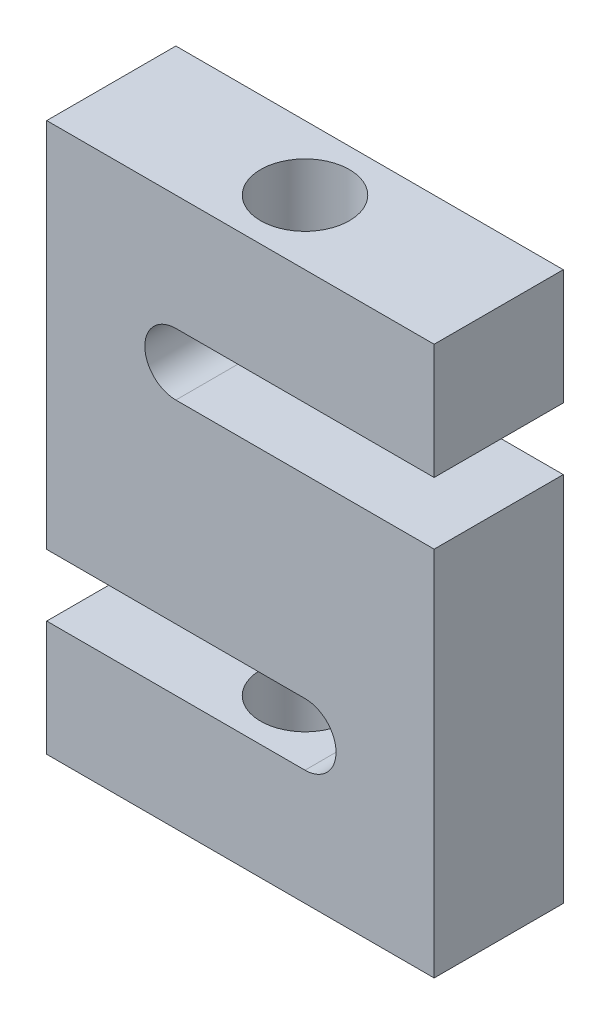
ISO-10303-21;
HEADER;
FILE_DESCRIPTION(('STEP AP214'),'2;1');
FILE_NAME('part.step','',(''),(''),'','','');
FILE_SCHEMA(('AUTOMOTIVE_DESIGN { 1 0 10303 214 1 1 1 1 }'));
ENDSEC;
DATA;
#1=APPLICATION_CONTEXT('core data for automotive mechanical design processes');
#2=APPLICATION_PROTOCOL_DEFINITION('international standard','automotive_design',2000,#1);
#3=PRODUCT_CONTEXT('',#1,'mechanical');
#4=PRODUCT('Part','Part','',(#3));
#5=PRODUCT_RELATED_PRODUCT_CATEGORY('part','',(#4));
#6=PRODUCT_DEFINITION_FORMATION('','',#4);
#7=PRODUCT_DEFINITION_CONTEXT('part definition',#1,'design');
#8=PRODUCT_DEFINITION('design','',#6,#7);
#9=PRODUCT_DEFINITION_SHAPE('','',#8);
#10=(LENGTH_UNIT() NAMED_UNIT(*) SI_UNIT(.MILLI.,.METRE.));
#11=(NAMED_UNIT(*) PLANE_ANGLE_UNIT() SI_UNIT($,.RADIAN.));
#12=(NAMED_UNIT(*) SI_UNIT($,.STERADIAN.) SOLID_ANGLE_UNIT());
#13=UNCERTAINTY_MEASURE_WITH_UNIT(LENGTH_MEASURE(1.E-05),#10,'distance_accuracy_value','');
#14=(GEOMETRIC_REPRESENTATION_CONTEXT(3) GLOBAL_UNCERTAINTY_ASSIGNED_CONTEXT((#13)) GLOBAL_UNIT_ASSIGNED_CONTEXT((#10,
#11,#12)) REPRESENTATION_CONTEXT('',''));
#15=CARTESIAN_POINT('',(0.,0.,0.));
#16=DIRECTION('',(0.,0.,1.));
#17=DIRECTION('',(1.,0.,0.));
#18=AXIS2_PLACEMENT_3D('',#15,#16,#17);
#19=CARTESIAN_POINT('',(38.1,19.075,12.7));
#20=DIRECTION('',(-1.,0.,0.));
#21=DIRECTION('',(0.,-1.,0.));
#22=AXIS2_PLACEMENT_3D('',#19,#20,#21);
#23=PLANE('',#22);
#24=DIRECTION('',(0.,1.,0.));
#25=VECTOR('',#24,1.);
#26=CARTESIAN_POINT('',(38.1,19.075,-12.7));
#27=LINE('',#26,#25);
#28=CARTESIAN_POINT('',(38.1,-53.975,-12.7));
#29=VERTEX_POINT('',#28);
#30=CARTESIAN_POINT('',(38.1,19.075,-12.7));
#31=VERTEX_POINT('',#30);
#32=EDGE_CURVE('E155',#29,#31,#27,.T.);
#33=ORIENTED_EDGE('',*,*,#32,.T.);
#34=DIRECTION('',(0.,0.,-1.));
#35=VECTOR('',#34,1.);
#36=CARTESIAN_POINT('',(38.1,19.075,12.7));
#37=LINE('',#36,#35);
#38=CARTESIAN_POINT('',(38.1,19.075,12.7));
#39=VERTEX_POINT('',#38);
#40=EDGE_CURVE('E11',#39,#31,#37,.T.);
#41=ORIENTED_EDGE('',*,*,#40,.F.);
#42=DIRECTION('',(0.,1.,0.));
#43=VECTOR('',#42,1.);
#44=CARTESIAN_POINT('',(38.1,19.075,12.7));
#45=LINE('',#44,#43);
#46=CARTESIAN_POINT('',(38.1,-53.975,12.7));
#47=VERTEX_POINT('',#46);
#48=EDGE_CURVE('E178',#47,#39,#45,.T.);
#49=ORIENTED_EDGE('',*,*,#48,.F.);
#50=DIRECTION('',(0.,0.,-1.));
#51=VECTOR('',#50,1.);
#52=CARTESIAN_POINT('',(38.1,-53.975,12.7));
#53=LINE('',#52,#51);
#54=EDGE_CURVE('E151',#47,#29,#53,.T.);
#55=ORIENTED_EDGE('',*,*,#54,.T.);
#56=EDGE_LOOP('',(#33,#41,#49,#55));
#57=FACE_BOUND('',#56,.T.);
#58=ADVANCED_FACE('F35',(#57),#23,.F.);
#59=CARTESIAN_POINT('',(38.1,19.075,12.7));
#60=DIRECTION('',(0.,-1.,0.));
#61=DIRECTION('',(1.,0.,0.));
#62=AXIS2_PLACEMENT_3D('',#59,#60,#61);
#63=PLANE('',#62);
#64=DIRECTION('',(-1.,0.,0.));
#65=VECTOR('',#64,1.);
#66=CARTESIAN_POINT('',(38.1,19.075,-12.7));
#67=LINE('',#66,#65);
#68=CARTESIAN_POINT('',(-12.7,19.075,-12.7));
#69=VERTEX_POINT('',#68);
#70=EDGE_CURVE('E158',#31,#69,#67,.T.);
#71=ORIENTED_EDGE('',*,*,#70,.T.);
#72=DIRECTION('',(0.,0.,-1.));
#73=VECTOR('',#72,1.);
#74=CARTESIAN_POINT('',(-12.7,19.075,12.7));
#75=LINE('',#74,#73);
#76=CARTESIAN_POINT('',(-12.7,19.075,12.7));
#77=VERTEX_POINT('',#76);
#78=EDGE_CURVE('E43',#77,#69,#75,.T.);
#79=ORIENTED_EDGE('',*,*,#78,.F.);
#80=DIRECTION('',(-1.,0.,0.));
#81=VECTOR('',#80,1.);
#82=CARTESIAN_POINT('',(38.1,19.075,12.7));
#83=LINE('',#82,#81);
#84=EDGE_CURVE('E106',#39,#77,#83,.T.);
#85=ORIENTED_EDGE('',*,*,#84,.F.);
#86=ORIENTED_EDGE('',*,*,#40,.T.);
#87=EDGE_LOOP('',(#71,#79,#85,#86));
#88=FACE_BOUND('',#87,.T.);
#89=ADVANCED_FACE('F258',(#88),#63,.F.);
#90=CARTESIAN_POINT('',(-12.7,25.175,12.7));
#91=DIRECTION('',(0.,0.,-1.));
#92=DIRECTION('',(-1.,0.,0.));
#93=AXIS2_PLACEMENT_3D('',#90,#91,#92);
#94=CYLINDRICAL_SURFACE('',#93,6.09999999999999);
#95=CARTESIAN_POINT('',(-12.7,25.175,-12.7));
#96=DIRECTION('',(0.,0.,-1.));
#97=DIRECTION('',(1.,0.,0.));
#98=AXIS2_PLACEMENT_3D('',#95,#96,#97);
#99=CIRCLE('',#98,6.09999999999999);
#100=CARTESIAN_POINT('',(-12.7,31.275,-12.7));
#101=VERTEX_POINT('',#100);
#102=EDGE_CURVE('E161',#69,#101,#99,.T.);
#103=ORIENTED_EDGE('',*,*,#102,.T.);
#104=DIRECTION('',(0.,0.,-1.));
#105=VECTOR('',#104,1.);
#106=CARTESIAN_POINT('',(-12.7,31.275,12.7));
#107=LINE('',#106,#105);
#108=CARTESIAN_POINT('',(-12.7,31.275,12.7));
#109=VERTEX_POINT('',#108);
#110=EDGE_CURVE('E197',#109,#101,#107,.T.);
#111=ORIENTED_EDGE('',*,*,#110,.F.);
#112=CARTESIAN_POINT('',(-12.7,25.175,12.7));
#113=DIRECTION('',(0.,0.,-1.));
#114=DIRECTION('',(1.,0.,0.));
#115=AXIS2_PLACEMENT_3D('',#112,#113,#114);
#116=CIRCLE('',#115,6.09999999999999);
#117=EDGE_CURVE('E205',#77,#109,#116,.T.);
#118=ORIENTED_EDGE('',*,*,#117,.F.);
#119=ORIENTED_EDGE('',*,*,#78,.T.);
#120=EDGE_LOOP('',(#103,#111,#118,#119));
#121=FACE_BOUND('',#120,.T.);
#122=ADVANCED_FACE('F203',(#121),#94,.F.);
#123=CARTESIAN_POINT('',(38.1,31.275,12.7));
#124=DIRECTION('',(0.,1.,0.));
#125=DIRECTION('',(-1.,0.,0.));
#126=AXIS2_PLACEMENT_3D('',#123,#124,#125);
#127=PLANE('',#126);
#128=CARTESIAN_POINT('',(0.,31.275,0.));
#129=DIRECTION('',(0.,1.,0.));
#130=DIRECTION('',(-1.,0.,0.));
#131=AXIS2_PLACEMENT_3D('',#128,#129,#130);
#132=CIRCLE('',#131,8.73124999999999);
#133=CARTESIAN_POINT('',(-8.73124999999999,31.275,0.));
#134=VERTEX_POINT('',#133);
#135=EDGE_CURVE('E159',#134,#134,#132,.T.);
#136=ORIENTED_EDGE('',*,*,#135,.T.);
#137=EDGE_LOOP('',(#136));
#138=FACE_BOUND('',#137,.T.);
#139=DIRECTION('',(1.,0.,0.));
#140=VECTOR('',#139,1.);
#141=CARTESIAN_POINT('',(38.1,31.275,-12.7));
#142=LINE('',#141,#140);
#143=CARTESIAN_POINT('',(38.1,31.275,-12.7));
#144=VERTEX_POINT('',#143);
#145=EDGE_CURVE('E163',#101,#144,#142,.T.);
#146=ORIENTED_EDGE('',*,*,#145,.T.);
#147=DIRECTION('',(0.,0.,-1.));
#148=VECTOR('',#147,1.);
#149=CARTESIAN_POINT('',(38.1,31.275,12.7));
#150=LINE('',#149,#148);
#151=CARTESIAN_POINT('',(38.1,31.275,12.7));
#152=VERTEX_POINT('',#151);
#153=EDGE_CURVE('E194',#152,#144,#150,.T.);
#154=ORIENTED_EDGE('',*,*,#153,.F.);
#155=DIRECTION('',(1.,0.,0.));
#156=VECTOR('',#155,1.);
#157=CARTESIAN_POINT('',(38.1,31.275,12.7));
#158=LINE('',#157,#156);
#159=EDGE_CURVE('E223',#109,#152,#158,.T.);
#160=ORIENTED_EDGE('',*,*,#159,.F.);
#161=ORIENTED_EDGE('',*,*,#110,.T.);
#162=EDGE_LOOP('',(#146,#154,#160,#161));
#163=FACE_BOUND('',#162,.T.);
#164=ADVANCED_FACE('F214',(#138,#163),#127,.F.);
#165=CARTESIAN_POINT('',(38.1,53.975,12.7));
#166=DIRECTION('',(-1.,0.,0.));
#167=DIRECTION('',(0.,0.,1.));
#168=AXIS2_PLACEMENT_3D('',#165,#166,#167);
#169=PLANE('',#168);
#170=DIRECTION('',(0.,1.,0.));
#171=VECTOR('',#170,1.);
#172=CARTESIAN_POINT('',(38.1,53.975,-12.7));
#173=LINE('',#172,#171);
#174=CARTESIAN_POINT('',(38.1,53.975,-12.7));
#175=VERTEX_POINT('',#174);
#176=EDGE_CURVE('E165',#144,#175,#173,.T.);
#177=ORIENTED_EDGE('',*,*,#176,.T.);
#178=DIRECTION('',(0.,0.,-1.));
#179=VECTOR('',#178,1.);
#180=CARTESIAN_POINT('',(38.1,53.975,12.7));
#181=LINE('',#180,#179);
#182=CARTESIAN_POINT('',(38.1,53.975,12.7));
#183=VERTEX_POINT('',#182);
#184=EDGE_CURVE('E191',#183,#175,#181,.T.);
#185=ORIENTED_EDGE('',*,*,#184,.F.);
#186=DIRECTION('',(0.,1.,0.));
#187=VECTOR('',#186,1.);
#188=CARTESIAN_POINT('',(38.1,53.975,12.7));
#189=LINE('',#188,#187);
#190=EDGE_CURVE('E220',#152,#183,#189,.T.);
#191=ORIENTED_EDGE('',*,*,#190,.F.);
#192=ORIENTED_EDGE('',*,*,#153,.T.);
#193=EDGE_LOOP('',(#177,#185,#191,#192));
#194=FACE_BOUND('',#193,.T.);
#195=ADVANCED_FACE('F218',(#194),#169,.F.);
#196=CARTESIAN_POINT('',(-38.1,53.975,12.7));
#197=DIRECTION('',(0.,-1.,0.));
#198=DIRECTION('',(0.,0.,-1.));
#199=AXIS2_PLACEMENT_3D('',#196,#197,#198);
#200=PLANE('',#199);
#201=CARTESIAN_POINT('',(0.,53.975,0.));
#202=DIRECTION('',(0.,1.,0.));
#203=DIRECTION('',(0.,0.,1.));
#204=AXIS2_PLACEMENT_3D('',#201,#202,#203);
#205=CIRCLE('',#204,8.73124999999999);
#206=CARTESIAN_POINT('',(0.,53.975,8.73124999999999));
#207=VERTEX_POINT('',#206);
#208=EDGE_CURVE('E292',#207,#207,#205,.T.);
#209=ORIENTED_EDGE('',*,*,#208,.F.);
#210=EDGE_LOOP('',(#209));
#211=FACE_BOUND('',#210,.T.);
#212=DIRECTION('',(-1.,0.,0.));
#213=VECTOR('',#212,1.);
#214=CARTESIAN_POINT('',(-38.1,53.975,-12.7));
#215=LINE('',#214,#213);
#216=CARTESIAN_POINT('',(-38.1,53.975,-12.7));
#217=VERTEX_POINT('',#216);
#218=EDGE_CURVE('E167',#175,#217,#215,.T.);
#219=ORIENTED_EDGE('',*,*,#218,.T.);
#220=DIRECTION('',(0.,0.,-1.));
#221=VECTOR('',#220,1.);
#222=CARTESIAN_POINT('',(-38.1,53.975,12.7));
#223=LINE('',#222,#221);
#224=CARTESIAN_POINT('',(-38.1,53.975,12.7));
#225=VERTEX_POINT('',#224);
#226=EDGE_CURVE('E188',#225,#217,#223,.T.);
#227=ORIENTED_EDGE('',*,*,#226,.F.);
#228=DIRECTION('',(-1.,0.,0.));
#229=VECTOR('',#228,1.);
#230=CARTESIAN_POINT('',(-38.1,53.975,12.7));
#231=LINE('',#230,#229);
#232=EDGE_CURVE('E222',#183,#225,#231,.T.);
#233=ORIENTED_EDGE('',*,*,#232,.F.);
#234=ORIENTED_EDGE('',*,*,#184,.T.);
#235=EDGE_LOOP('',(#219,#227,#233,#234));
#236=FACE_BOUND('',#235,.T.);
#237=ADVANCED_FACE('F272',(#211,#236),#200,.F.);
#238=CARTESIAN_POINT('',(-38.1,53.975,12.7));
#239=DIRECTION('',(1.,0.,0.));
#240=DIRECTION('',(0.,1.,0.));
#241=AXIS2_PLACEMENT_3D('',#238,#239,#240);
#242=PLANE('',#241);
#243=DIRECTION('',(0.,-1.,0.));
#244=VECTOR('',#243,1.);
#245=CARTESIAN_POINT('',(-38.1,53.975,-12.7));
#246=LINE('',#245,#244);
#247=CARTESIAN_POINT('',(-38.1,-19.075,-12.7));
#248=VERTEX_POINT('',#247);
#249=EDGE_CURVE('E169',#217,#248,#246,.T.);
#250=ORIENTED_EDGE('',*,*,#249,.T.);
#251=DIRECTION('',(0.,0.,-1.));
#252=VECTOR('',#251,1.);
#253=CARTESIAN_POINT('',(-38.1,-19.075,12.7));
#254=LINE('',#253,#252);
#255=CARTESIAN_POINT('',(-38.1,-19.075,12.7));
#256=VERTEX_POINT('',#255);
#257=EDGE_CURVE('E185',#256,#248,#254,.T.);
#258=ORIENTED_EDGE('',*,*,#257,.F.);
#259=DIRECTION('',(0.,-1.,0.));
#260=VECTOR('',#259,1.);
#261=CARTESIAN_POINT('',(-38.1,53.975,12.7));
#262=LINE('',#261,#260);
#263=EDGE_CURVE('E225',#225,#256,#262,.T.);
#264=ORIENTED_EDGE('',*,*,#263,.F.);
#265=ORIENTED_EDGE('',*,*,#226,.T.);
#266=EDGE_LOOP('',(#250,#258,#264,#265));
#267=FACE_BOUND('',#266,.T.);
#268=ADVANCED_FACE('F275',(#267),#242,.F.);
#269=CARTESIAN_POINT('',(-38.1,-19.075,12.7));
#270=DIRECTION('',(0.,1.,0.));
#271=DIRECTION('',(-1.,0.,0.));
#272=AXIS2_PLACEMENT_3D('',#269,#270,#271);
#273=PLANE('',#272);
#274=DIRECTION('',(1.,0.,0.));
#275=VECTOR('',#274,1.);
#276=CARTESIAN_POINT('',(-38.1,-19.075,-12.7));
#277=LINE('',#276,#275);
#278=CARTESIAN_POINT('',(12.7,-19.075,-12.7));
#279=VERTEX_POINT('',#278);
#280=EDGE_CURVE('E171',#248,#279,#277,.T.);
#281=ORIENTED_EDGE('',*,*,#280,.T.);
#282=DIRECTION('',(0.,0.,-1.));
#283=VECTOR('',#282,1.);
#284=CARTESIAN_POINT('',(12.7,-19.075,12.7));
#285=LINE('',#284,#283);
#286=CARTESIAN_POINT('',(12.7,-19.075,12.7));
#287=VERTEX_POINT('',#286);
#288=EDGE_CURVE('E182',#287,#279,#285,.T.);
#289=ORIENTED_EDGE('',*,*,#288,.F.);
#290=DIRECTION('',(1.,0.,0.));
#291=VECTOR('',#290,1.);
#292=CARTESIAN_POINT('',(-38.1,-19.075,12.7));
#293=LINE('',#292,#291);
#294=EDGE_CURVE('E231',#256,#287,#293,.T.);
#295=ORIENTED_EDGE('',*,*,#294,.F.);
#296=ORIENTED_EDGE('',*,*,#257,.T.);
#297=EDGE_LOOP('',(#281,#289,#295,#296));
#298=FACE_BOUND('',#297,.T.);
#299=ADVANCED_FACE('F237',(#298),#273,.F.);
#300=CARTESIAN_POINT('',(12.7,-25.175,12.7));
#301=DIRECTION('',(0.,0.,-1.));
#302=DIRECTION('',(-1.,0.,0.));
#303=AXIS2_PLACEMENT_3D('',#300,#301,#302);
#304=CYLINDRICAL_SURFACE('',#303,6.09999999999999);
#305=CARTESIAN_POINT('',(12.7,-25.175,-12.7));
#306=DIRECTION('',(0.,0.,-1.));
#307=DIRECTION('',(1.,0.,0.));
#308=AXIS2_PLACEMENT_3D('',#305,#306,#307);
#309=CIRCLE('',#308,6.09999999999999);
#310=CARTESIAN_POINT('',(12.7,-31.275,-12.7));
#311=VERTEX_POINT('',#310);
#312=EDGE_CURVE('E173',#279,#311,#309,.T.);
#313=ORIENTED_EDGE('',*,*,#312,.T.);
#314=DIRECTION('',(0.,0.,-1.));
#315=VECTOR('',#314,1.);
#316=CARTESIAN_POINT('',(12.7,-31.275,12.7));
#317=LINE('',#316,#315);
#318=CARTESIAN_POINT('',(12.7,-31.275,12.7));
#319=VERTEX_POINT('',#318);
#320=EDGE_CURVE('E146',#319,#311,#317,.T.);
#321=ORIENTED_EDGE('',*,*,#320,.F.);
#322=CARTESIAN_POINT('',(12.7,-25.175,12.7));
#323=DIRECTION('',(0.,0.,-1.));
#324=DIRECTION('',(1.,0.,0.));
#325=AXIS2_PLACEMENT_3D('',#322,#323,#324);
#326=CIRCLE('',#325,6.09999999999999);
#327=EDGE_CURVE('E137',#287,#319,#326,.T.);
#328=ORIENTED_EDGE('',*,*,#327,.F.);
#329=ORIENTED_EDGE('',*,*,#288,.T.);
#330=EDGE_LOOP('',(#313,#321,#328,#329));
#331=FACE_BOUND('',#330,.T.);
#332=ADVANCED_FACE('F241',(#331),#304,.F.);
#333=CARTESIAN_POINT('',(12.7,-31.275,12.7));
#334=DIRECTION('',(0.,-1.,0.));
#335=DIRECTION('',(1.,0.,0.));
#336=AXIS2_PLACEMENT_3D('',#333,#334,#335);
#337=PLANE('',#336);
#338=CARTESIAN_POINT('',(0.,-31.275,0.));
#339=DIRECTION('',(0.,-1.,0.));
#340=DIRECTION('',(1.,0.,0.));
#341=AXIS2_PLACEMENT_3D('',#338,#339,#340);
#342=CIRCLE('',#341,8.73124999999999);
#343=CARTESIAN_POINT('',(8.73124999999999,-31.275,0.));
#344=VERTEX_POINT('',#343);
#345=EDGE_CURVE('E290',#344,#344,#342,.T.);
#346=ORIENTED_EDGE('',*,*,#345,.T.);
#347=EDGE_LOOP('',(#346));
#348=FACE_BOUND('',#347,.T.);
#349=DIRECTION('',(-1.,0.,0.));
#350=VECTOR('',#349,1.);
#351=CARTESIAN_POINT('',(12.7,-31.275,-12.7));
#352=LINE('',#351,#350);
#353=CARTESIAN_POINT('',(-38.1,-31.275,-12.7));
#354=VERTEX_POINT('',#353);
#355=EDGE_CURVE('E145',#311,#354,#352,.T.);
#356=ORIENTED_EDGE('',*,*,#355,.T.);
#357=DIRECTION('',(0.,0.,-1.));
#358=VECTOR('',#357,1.);
#359=CARTESIAN_POINT('',(-38.1,-31.275,12.7));
#360=LINE('',#359,#358);
#361=CARTESIAN_POINT('',(-38.1,-31.275,12.7));
#362=VERTEX_POINT('',#361);
#363=EDGE_CURVE('E142',#362,#354,#360,.T.);
#364=ORIENTED_EDGE('',*,*,#363,.F.);
#365=DIRECTION('',(-1.,0.,0.));
#366=VECTOR('',#365,1.);
#367=CARTESIAN_POINT('',(12.7,-31.275,12.7));
#368=LINE('',#367,#366);
#369=EDGE_CURVE('E131',#319,#362,#368,.T.);
#370=ORIENTED_EDGE('',*,*,#369,.F.);
#371=ORIENTED_EDGE('',*,*,#320,.T.);
#372=EDGE_LOOP('',(#356,#364,#370,#371));
#373=FACE_BOUND('',#372,.T.);
#374=ADVANCED_FACE('F143',(#348,#373),#337,.F.);
#375=CARTESIAN_POINT('',(-38.1,-31.275,12.7));
#376=DIRECTION('',(1.,0.,0.));
#377=DIRECTION('',(0.,1.,0.));
#378=AXIS2_PLACEMENT_3D('',#375,#376,#377);
#379=PLANE('',#378);
#380=DIRECTION('',(0.,-1.,0.));
#381=VECTOR('',#380,1.);
#382=CARTESIAN_POINT('',(-38.1,-31.275,-12.7));
#383=LINE('',#382,#381);
#384=CARTESIAN_POINT('',(-38.1,-53.975,-12.7));
#385=VERTEX_POINT('',#384);
#386=EDGE_CURVE('E92',#354,#385,#383,.T.);
#387=ORIENTED_EDGE('',*,*,#386,.T.);
#388=DIRECTION('',(0.,0.,-1.));
#389=VECTOR('',#388,1.);
#390=CARTESIAN_POINT('',(-38.1,-53.975,12.7));
#391=LINE('',#390,#389);
#392=CARTESIAN_POINT('',(-38.1,-53.975,12.7));
#393=VERTEX_POINT('',#392);
#394=EDGE_CURVE('E147',#393,#385,#391,.T.);
#395=ORIENTED_EDGE('',*,*,#394,.F.);
#396=DIRECTION('',(0.,-1.,0.));
#397=VECTOR('',#396,1.);
#398=CARTESIAN_POINT('',(-38.1,-31.275,12.7));
#399=LINE('',#398,#397);
#400=EDGE_CURVE('E135',#362,#393,#399,.T.);
#401=ORIENTED_EDGE('',*,*,#400,.F.);
#402=ORIENTED_EDGE('',*,*,#363,.T.);
#403=EDGE_LOOP('',(#387,#395,#401,#402));
#404=FACE_BOUND('',#403,.T.);
#405=ADVANCED_FACE('F149',(#404),#379,.F.);
#406=CARTESIAN_POINT('',(-38.1,-53.975,12.7));
#407=DIRECTION('',(0.,1.,0.));
#408=DIRECTION('',(0.,0.,1.));
#409=AXIS2_PLACEMENT_3D('',#406,#407,#408);
#410=PLANE('',#409);
#411=CARTESIAN_POINT('',(0.,-53.975,0.));
#412=DIRECTION('',(0.,-1.,0.));
#413=DIRECTION('',(0.,0.,-1.));
#414=AXIS2_PLACEMENT_3D('',#411,#412,#413);
#415=CIRCLE('',#414,8.73124999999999);
#416=CARTESIAN_POINT('',(0.,-53.975,-8.73124999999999));
#417=VERTEX_POINT('',#416);
#418=EDGE_CURVE('E293',#417,#417,#415,.T.);
#419=ORIENTED_EDGE('',*,*,#418,.F.);
#420=EDGE_LOOP('',(#419));
#421=FACE_BOUND('',#420,.T.);
#422=DIRECTION('',(1.,0.,0.));
#423=VECTOR('',#422,1.);
#424=CARTESIAN_POINT('',(-38.1,-53.975,-12.7));
#425=LINE('',#424,#423);
#426=EDGE_CURVE('E98',#385,#29,#425,.T.);
#427=ORIENTED_EDGE('',*,*,#426,.T.);
#428=ORIENTED_EDGE('',*,*,#54,.F.);
#429=DIRECTION('',(1.,0.,0.));
#430=VECTOR('',#429,1.);
#431=CARTESIAN_POINT('',(-38.1,-53.975,12.7));
#432=LINE('',#431,#430);
#433=EDGE_CURVE('E51',#393,#47,#432,.T.);
#434=ORIENTED_EDGE('',*,*,#433,.F.);
#435=ORIENTED_EDGE('',*,*,#394,.T.);
#436=EDGE_LOOP('',(#427,#428,#434,#435));
#437=FACE_BOUND('',#436,.T.);
#438=ADVANCED_FACE('F245',(#421,#437),#410,.F.);
#439=CARTESIAN_POINT('',(12.7,-25.175,12.7));
#440=DIRECTION('',(0.,0.,1.));
#441=DIRECTION('',(1.,0.,0.));
#442=AXIS2_PLACEMENT_3D('',#439,#440,#441);
#443=PLANE('',#442);
#444=ORIENTED_EDGE('',*,*,#48,.T.);
#445=ORIENTED_EDGE('',*,*,#84,.T.);
#446=ORIENTED_EDGE('',*,*,#117,.T.);
#447=ORIENTED_EDGE('',*,*,#159,.T.);
#448=ORIENTED_EDGE('',*,*,#190,.T.);
#449=ORIENTED_EDGE('',*,*,#232,.T.);
#450=ORIENTED_EDGE('',*,*,#263,.T.);
#451=ORIENTED_EDGE('',*,*,#294,.T.);
#452=ORIENTED_EDGE('',*,*,#327,.T.);
#453=ORIENTED_EDGE('',*,*,#369,.T.);
#454=ORIENTED_EDGE('',*,*,#400,.T.);
#455=ORIENTED_EDGE('',*,*,#433,.T.);
#456=EDGE_LOOP('',(#444,#445,#446,#447,#448,#449,#450,#451,#452,#453,#454,#455));
#457=FACE_BOUND('',#456,.T.);
#458=ADVANCED_FACE('F133',(#457),#443,.T.);
#459=CARTESIAN_POINT('',(12.7,-25.175,-12.7));
#460=DIRECTION('',(0.,0.,1.));
#461=DIRECTION('',(1.,0.,0.));
#462=AXIS2_PLACEMENT_3D('',#459,#460,#461);
#463=PLANE('',#462);
#464=ORIENTED_EDGE('',*,*,#32,.F.);
#465=ORIENTED_EDGE('',*,*,#426,.F.);
#466=ORIENTED_EDGE('',*,*,#386,.F.);
#467=ORIENTED_EDGE('',*,*,#355,.F.);
#468=ORIENTED_EDGE('',*,*,#312,.F.);
#469=ORIENTED_EDGE('',*,*,#280,.F.);
#470=ORIENTED_EDGE('',*,*,#249,.F.);
#471=ORIENTED_EDGE('',*,*,#218,.F.);
#472=ORIENTED_EDGE('',*,*,#176,.F.);
#473=ORIENTED_EDGE('',*,*,#145,.F.);
#474=ORIENTED_EDGE('',*,*,#102,.F.);
#475=ORIENTED_EDGE('',*,*,#70,.F.);
#476=EDGE_LOOP('',(#464,#465,#466,#467,#468,#469,#470,#471,#472,#473,#474,#475));
#477=FACE_BOUND('',#476,.T.);
#478=ADVANCED_FACE('F209',(#477),#463,.F.);
#479=CARTESIAN_POINT('',(0.,53.975,0.));
#480=DIRECTION('',(0.,1.,0.));
#481=DIRECTION('',(0.,0.,1.));
#482=AXIS2_PLACEMENT_3D('',#479,#480,#481);
#483=CYLINDRICAL_SURFACE('',#482,8.73124999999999);
#484=ORIENTED_EDGE('',*,*,#135,.F.);
#485=EDGE_LOOP('',(#484));
#486=FACE_BOUND('',#485,.T.);
#487=ORIENTED_EDGE('',*,*,#208,.T.);
#488=EDGE_LOOP('',(#487));
#489=FACE_BOUND('',#488,.T.);
#490=ADVANCED_FACE('F305',(#486,#489),#483,.F.);
#491=CARTESIAN_POINT('',(0.,-53.975,0.));
#492=DIRECTION('',(0.,-1.,0.));
#493=DIRECTION('',(0.,0.,-1.));
#494=AXIS2_PLACEMENT_3D('',#491,#492,#493);
#495=CYLINDRICAL_SURFACE('',#494,8.73124999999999);
#496=ORIENTED_EDGE('',*,*,#345,.F.);
#497=EDGE_LOOP('',(#496));
#498=FACE_BOUND('',#497,.T.);
#499=ORIENTED_EDGE('',*,*,#418,.T.);
#500=EDGE_LOOP('',(#499));
#501=FACE_BOUND('',#500,.T.);
#502=ADVANCED_FACE('F308',(#498,#501),#495,.F.);
#503=CLOSED_SHELL('',(#58,#89,#122,#164,#195,#237,#268,#299,#332,#374,#405,#438,#458,#478,#490,#502));
#504=MANIFOLD_SOLID_BREP('B2',#503);
#505=ADVANCED_BREP_SHAPE_REPRESENTATION('',(#18,#504),#14);
#506=SHAPE_DEFINITION_REPRESENTATION(#9,#505);
ENDSEC;
END-ISO-10303-21;
